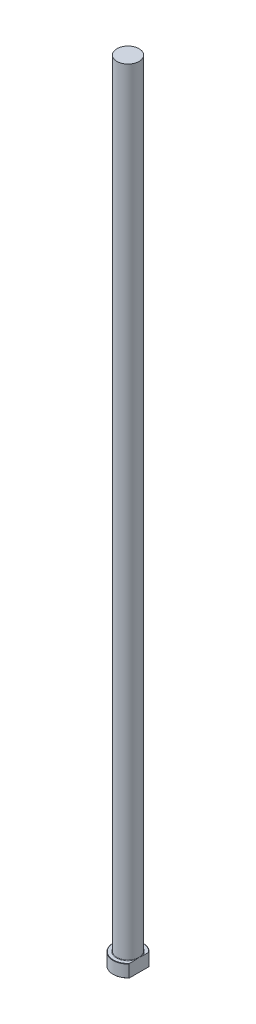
from build123d import *
from build123d.topology import SkipClean

# Parameters (mm, degrees)
CHAMFER1_SIZE    = 0.2
FILLET1_R        = 0.3
KEYED_HEAD_DEPTH = 501.180467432


with BuildPart() as part:
    # Sketch1 → Revolve1 (revolve)
    with BuildSketch(Plane.XY, mode=Mode.PRIVATE) as revolve1_sk:
        Polygon((0, 0), (-9.5, 0), (-9.5, 8), (-7, 8), (-7, 500), (0, 500), align=None)
    revolve(revolve1_sk.sketch.rotate(Axis((0, 259.958771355, 0), (0, -1, 0)), 270), axis=Axis((0, 259.958771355, 0), (0, -1, 0)))

    # Chamfer1
    chamfer1_edges = [part.edges().sort_by_distance(p)[0] for p in [
        (0, 8, -9.5),
        (0, 0, -9.5),
    ]]
    chamfer(chamfer1_edges, length=CHAMFER1_SIZE)

    # Fillet1
    fillet1_edges = [part.edges().sort_by_distance(p)[0] for p in [
        (0, 8, -7),
    ]]
    fillet(fillet1_edges, radius=FILLET1_R)

    # Sketch2 → KEYED HEAD (cut, through all)
    with SkipClean():  # the faces are left unmerged after this step: merging them gives an invalid solid
        with BuildSketch(Plane(origin=(0, 0, 0), x_dir=(1, 0, 0), z_dir=(0, 1, 0))):
            with BuildLine():
                Line((7, -6.422616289), (7, 6.422616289))
                ThreePointArc((7, 6.422616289), (9.5, 0), (7, -6.422616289))
            make_face()
        extrude(amount=KEYED_HEAD_DEPTH, mode=Mode.SUBTRACT)


solid = part.part
